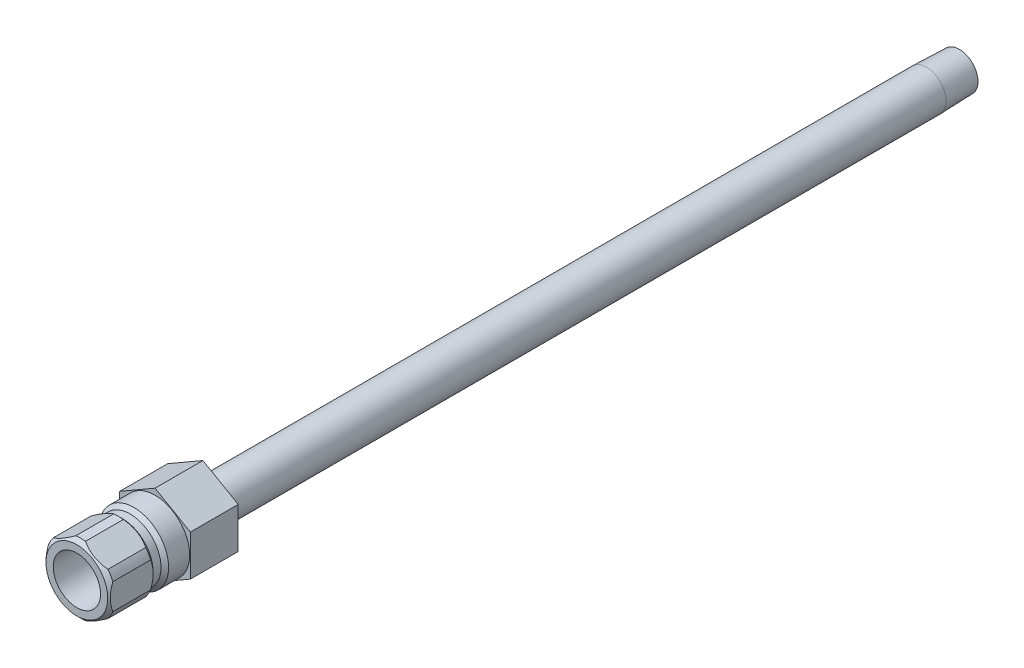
from build123d import *

# Parameters (mm, degrees)
SKETCH2_R           = 2.6543
BOSS_EXTRUDE1_DEPTH = 9.652
CUT_EXTRUDE1_START  = 6.604
SKETCH3_OUTSIDE_W   = 52.048
SKETCH3_OUTSIDE_H   = 54.248
CUT_EXTRUDE1_DEPTH  = 156.811738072


with BuildPart() as part:
    # Sketch1 → Revolve1 (revolve)
    with BuildSketch(Plane(origin=(0, 0, 0), x_dir=(0, 0, -1), z_dir=(1, 0, 0))):
        Polygon((-15.748, 4.7625), (-15.748, 6.223), (-14.986, 6.985), (-7.366, 6.985), (-6.604, 6.223), (-5.0165, 6.223), (-4.2545, 6.985), (9.652, 6.985), (9.652, 3.96875), (155.4226, 3.96875), (162.052, 3.761582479), (162.052, 2.6543), (-2.435050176, 2.6543), (-3.556, 4.7625), align=None)
    revolve(axis=Axis((0, 0, -9.652), (0, 0, 1)))

    # Sketch2 → Boss-Extrude1 (add)
    with BuildSketch(Plane.XY):
        Polygon((-7.112, 4.106115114), (-7.112, -4.106115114), (0, -8.212230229), (7.112, -4.106115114), (7.112, 4.106115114), (0, 8.212230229), align=None)
        with Locations(Location((0, 0, 0), (0, 0, 90))):
            Circle(SKETCH2_R, mode=Mode.SUBTRACT)
    extrude(amount=-BOSS_EXTRUDE1_DEPTH)

    # Sketch3 outside → Cut-Extrude1 (cut, through all)
    with BuildSketch(Plane.XY.offset(CUT_EXTRUDE1_START)):
        Rectangle(SKETCH3_OUTSIDE_W, SKETCH3_OUTSIDE_H)
        Polygon((6.477, 3.739497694), (0, 7.478995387), (-6.477, 3.739497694), (-6.477, -3.739497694), (0, -7.478995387), (6.477, -3.739497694), align=None, mode=Mode.SUBTRACT)
    extrude(amount=CUT_EXTRUDE1_DEPTH, mode=Mode.SUBTRACT)


solid = part.part
